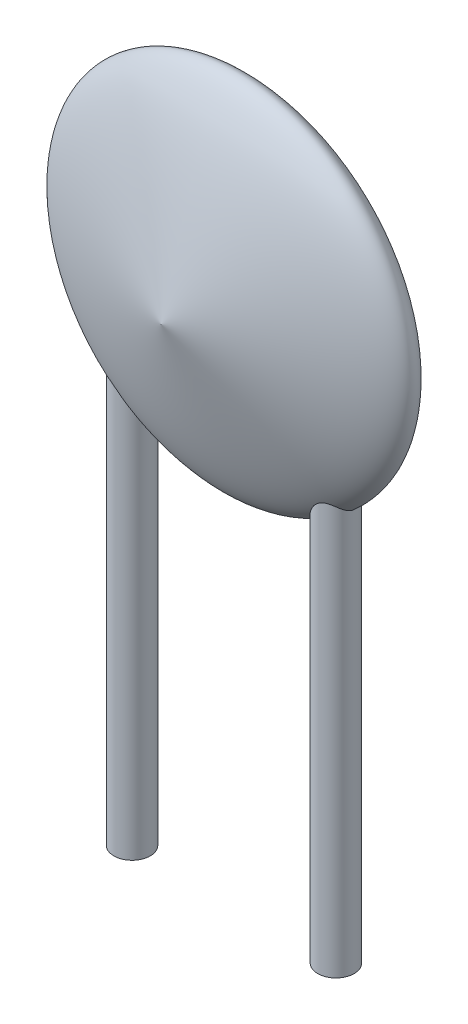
ISO-10303-21;
HEADER;
FILE_DESCRIPTION(('STEP AP214'),'2;1');
FILE_NAME('part.step','',(''),(''),'','','');
FILE_SCHEMA(('AUTOMOTIVE_DESIGN { 1 0 10303 214 1 1 1 1 }'));
ENDSEC;
DATA;
#1=APPLICATION_CONTEXT('core data for automotive mechanical design processes');
#2=APPLICATION_PROTOCOL_DEFINITION('international standard','automotive_design',2000,#1);
#3=PRODUCT_CONTEXT('',#1,'mechanical');
#4=PRODUCT('Part','Part','',(#3));
#5=PRODUCT_RELATED_PRODUCT_CATEGORY('part','',(#4));
#6=PRODUCT_DEFINITION_FORMATION('','',#4);
#7=PRODUCT_DEFINITION_CONTEXT('part definition',#1,'design');
#8=PRODUCT_DEFINITION('design','',#6,#7);
#9=PRODUCT_DEFINITION_SHAPE('','',#8);
#10=(LENGTH_UNIT() NAMED_UNIT(*) SI_UNIT(.MILLI.,.METRE.));
#11=(NAMED_UNIT(*) PLANE_ANGLE_UNIT() SI_UNIT($,.RADIAN.));
#12=(NAMED_UNIT(*) SI_UNIT($,.STERADIAN.) SOLID_ANGLE_UNIT());
#13=UNCERTAINTY_MEASURE_WITH_UNIT(LENGTH_MEASURE(1.E-05),#10,'distance_accuracy_value','');
#14=(GEOMETRIC_REPRESENTATION_CONTEXT(3) GLOBAL_UNCERTAINTY_ASSIGNED_CONTEXT((#13)) GLOBAL_UNIT_ASSIGNED_CONTEXT((#10,
#11,#12)) REPRESENTATION_CONTEXT('',''));
#15=CARTESIAN_POINT('',(0.,0.,0.));
#16=DIRECTION('',(0.,0.,1.));
#17=DIRECTION('',(1.,0.,0.));
#18=AXIS2_PLACEMENT_3D('',#15,#16,#17);
#19=CARTESIAN_POINT('',(-1.4,-7.4,0.));
#20=DIRECTION('',(0.,1.,0.));
#21=DIRECTION('',(0.,0.,1.));
#22=AXIS2_PLACEMENT_3D('',#19,#20,#21);
#23=CYLINDRICAL_SURFACE('',#22,0.25);
#24=CARTESIAN_POINT('',(-1.4,-7.4,0.));
#25=DIRECTION('',(0.,1.,0.));
#26=DIRECTION('',(0.,0.,1.));
#27=AXIS2_PLACEMENT_3D('',#24,#25,#26);
#28=CIRCLE('',#27,0.25);
#29=CARTESIAN_POINT('',(-1.4,-7.4,0.25));
#30=VERTEX_POINT('',#29);
#31=EDGE_CURVE('E40',#30,#30,#28,.T.);
#32=ORIENTED_EDGE('',*,*,#31,.T.);
#33=EDGE_LOOP('',(#32));
#34=FACE_BOUND('',#33,.T.);
#35=CARTESIAN_POINT('',(-1.4,-1.80608390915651,0.25));
#36=CARTESIAN_POINT('',(-1.38321930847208,-1.81908925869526,0.250001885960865));
#37=CARTESIAN_POINT('',(-1.36790400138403,-1.83402348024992,0.248350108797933));
#38=CARTESIAN_POINT('',(-1.33945258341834,-1.86557712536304,0.242992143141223));
#39=CARTESIAN_POINT('',(-1.32634121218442,-1.88221268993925,0.239264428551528));
#40=CARTESIAN_POINT('',(-1.3028636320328,-1.91471312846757,0.230661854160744));
#41=CARTESIAN_POINT('',(-1.2923564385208,-1.93051190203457,0.225921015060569));
#42=CARTESIAN_POINT('',(-1.2724047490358,-1.96240689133,0.215284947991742));
#43=CARTESIAN_POINT('',(-1.26296164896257,-1.97850346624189,0.209388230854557));
#44=CARTESIAN_POINT('',(-1.24497755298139,-2.01071773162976,0.19644485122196));
#45=CARTESIAN_POINT('',(-1.23643572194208,-2.02683538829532,0.189399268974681));
#46=CARTESIAN_POINT('',(-1.2201670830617,-2.05884202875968,0.174026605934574));
#47=CARTESIAN_POINT('',(-1.21243933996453,-2.0747312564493,0.165701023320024));
#48=CARTESIAN_POINT('',(-1.19759699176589,-2.10637196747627,0.147234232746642));
#49=CARTESIAN_POINT('',(-1.19050196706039,-2.12211061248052,0.137053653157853));
#50=CARTESIAN_POINT('',(-1.18063347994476,-2.144710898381,0.120084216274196));
#51=CARTESIAN_POINT('',(-1.17748084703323,-2.15205696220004,0.114163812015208));
#52=CARTESIAN_POINT('',(-1.17147996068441,-2.16625267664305,0.101622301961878));
#53=CARTESIAN_POINT('',(-1.16863123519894,-2.17310309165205,0.0950023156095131));
#54=CARTESIAN_POINT('',(-1.16415002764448,-2.18402783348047,0.0830768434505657));
#55=CARTESIAN_POINT('',(-1.16241391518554,-2.1883053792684,0.0779982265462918));
#56=CARTESIAN_POINT('',(-1.1591806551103,-2.19634233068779,0.0673573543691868));
#57=CARTESIAN_POINT('',(-1.15768379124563,-2.20010112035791,0.0617945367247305));
#58=CARTESIAN_POINT('',(-1.15499037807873,-2.20691759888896,0.0500694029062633));
#59=CARTESIAN_POINT('',(-1.15379817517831,-2.20996509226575,0.043899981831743));
#60=CARTESIAN_POINT('',(-1.15185548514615,-2.21496201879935,0.0310780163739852));
#61=CARTESIAN_POINT('',(-1.15110296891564,-2.21691649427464,0.0244278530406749));
#62=CARTESIAN_POINT('',(-1.15026537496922,-2.21910039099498,0.0125795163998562));
#63=CARTESIAN_POINT('',(-1.15005831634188,-2.2196444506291,0.00744848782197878));
#64=CARTESIAN_POINT('',(-1.14996296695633,-2.21989419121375,-0.00283516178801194));
#65=CARTESIAN_POINT('',(-1.15007458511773,-2.21960011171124,-0.00798777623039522));
#66=CARTESIAN_POINT('',(-1.15087474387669,-2.21750954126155,-0.0232015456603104));
#67=CARTESIAN_POINT('',(-1.15202438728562,-2.21451557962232,-0.0330817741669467));
#68=CARTESIAN_POINT('',(-1.15490551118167,-2.20713374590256,-0.049889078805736));
#69=CARTESIAN_POINT('',(-1.15648822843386,-2.20311062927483,-0.0570230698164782));
#70=CARTESIAN_POINT('',(-1.1600668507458,-2.19412580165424,-0.0705739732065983));
#71=CARTESIAN_POINT('',(-1.16206387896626,-2.18916154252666,-0.0769888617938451));
#72=CARTESIAN_POINT('',(-1.16836372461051,-2.17370396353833,-0.094883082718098));
#73=CARTESIAN_POINT('',(-1.17307583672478,-2.1623828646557,-0.105485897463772));
#74=CARTESIAN_POINT('',(-1.18322529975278,-2.13867290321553,-0.125016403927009));
#75=CARTESIAN_POINT('',(-1.18866539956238,-2.12628005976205,-0.133937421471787));
#76=CARTESIAN_POINT('',(-1.20093259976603,-2.09916557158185,-0.151671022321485));
#77=CARTESIAN_POINT('',(-1.20784728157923,-2.08436056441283,-0.160294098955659));
#78=CARTESIAN_POINT('',(-1.22238766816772,-2.05440744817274,-0.176267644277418));
#79=CARTESIAN_POINT('',(-1.23001412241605,-2.03925899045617,-0.183616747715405));
#80=CARTESIAN_POINT('',(-1.24599329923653,-2.00889489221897,-0.197209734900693));
#81=CARTESIAN_POINT('',(-1.2543445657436,-1.99367944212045,-0.203455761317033));
#82=CARTESIAN_POINT('',(-1.27188483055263,-1.96335007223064,-0.214933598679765));
#83=CARTESIAN_POINT('',(-1.28107367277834,-1.94823613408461,-0.220165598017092));
#84=CARTESIAN_POINT('',(-1.29895831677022,-1.92065975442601,-0.228852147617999));
#85=CARTESIAN_POINT('',(-1.30750840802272,-1.9081506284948,-0.232456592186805));
#86=CARTESIAN_POINT('',(-1.3255108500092,-1.88353894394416,-0.238836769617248));
#87=CARTESIAN_POINT('',(-1.3349644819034,-1.87143699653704,-0.241611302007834));
#88=CARTESIAN_POINT('',(-1.35512447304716,-1.84784375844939,-0.246158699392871));
#89=CARTESIAN_POINT('',(-1.36584399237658,-1.83636109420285,-0.24791967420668));
#90=CARTESIAN_POINT('',(-1.38871423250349,-1.81482404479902,-0.250011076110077));
#91=CARTESIAN_POINT('',(-1.40085794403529,-1.80476316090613,-0.25034823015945));
#92=CARTESIAN_POINT('',(-1.42660090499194,-1.78752535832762,-0.248897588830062));
#93=CARTESIAN_POINT('',(-1.44014503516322,-1.78027042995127,-0.247173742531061));
#94=CARTESIAN_POINT('',(-1.461299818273,-1.77269295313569,-0.242478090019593));
#95=CARTESIAN_POINT('',(-1.46854118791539,-1.77071612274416,-0.240541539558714));
#96=CARTESIAN_POINT('',(-1.48303044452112,-1.76808103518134,-0.235930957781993));
#97=CARTESIAN_POINT('',(-1.4902783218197,-1.76742173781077,-0.233257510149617));
#98=CARTESIAN_POINT('',(-1.50367220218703,-1.76741700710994,-0.22759378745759));
#99=CARTESIAN_POINT('',(-1.50984942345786,-1.76792993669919,-0.224674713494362));
#100=CARTESIAN_POINT('',(-1.52183897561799,-1.76985354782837,-0.218405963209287));
#101=CARTESIAN_POINT('',(-1.52765068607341,-1.77126571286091,-0.215055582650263));
#102=CARTESIAN_POINT('',(-1.54187828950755,-1.77576961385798,-0.206094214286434));
#103=CARTESIAN_POINT('',(-1.54998562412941,-1.77935732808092,-0.200246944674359));
#104=CARTESIAN_POINT('',(-1.56514677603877,-1.78759135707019,-0.187943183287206));
#105=CARTESIAN_POINT('',(-1.57219576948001,-1.7922422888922,-0.181484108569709));
#106=CARTESIAN_POINT('',(-1.58992336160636,-1.80553626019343,-0.163354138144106));
#107=CARTESIAN_POINT('',(-1.59970463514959,-1.81470125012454,-0.151190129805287));
#108=CARTESIAN_POINT('',(-1.61690179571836,-1.83289313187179,-0.125286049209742));
#109=CARTESIAN_POINT('',(-1.62432104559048,-1.84192020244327,-0.111548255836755));
#110=CARTESIAN_POINT('',(-1.6370993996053,-1.85869194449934,-0.0810433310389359));
#111=CARTESIAN_POINT('',(-1.64232098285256,-1.86633737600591,-0.0641502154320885));
#112=CARTESIAN_POINT('',(-1.64710890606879,-1.87360354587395,-0.0386705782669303));
#113=CARTESIAN_POINT('',(-1.64819766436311,-1.87530443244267,-0.0309786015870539));
#114=CARTESIAN_POINT('',(-1.64964995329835,-1.87759548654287,-0.0153652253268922));
#115=CARTESIAN_POINT('',(-1.65001455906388,-1.87818730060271,-0.00744418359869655));
#116=CARTESIAN_POINT('',(-1.64998451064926,-1.87813918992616,0.00840884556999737));
#117=CARTESIAN_POINT('',(-1.6495882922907,-1.87749672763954,0.0163408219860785));
#118=CARTESIAN_POINT('',(-1.64807265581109,-1.87510886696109,0.031966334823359));
#119=CARTESIAN_POINT('',(-1.64695219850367,-1.87336188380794,0.0396595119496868));
#120=CARTESIAN_POINT('',(-1.64347892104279,-1.8681006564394,0.0577428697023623));
#121=CARTESIAN_POINT('',(-1.64080902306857,-1.86415533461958,0.0679437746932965));
#122=CARTESIAN_POINT('',(-1.63440814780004,-1.85518340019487,0.087518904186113));
#123=CARTESIAN_POINT('',(-1.63067271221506,-1.85015226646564,0.0968894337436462));
#124=CARTESIAN_POINT('',(-1.61965672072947,-1.83623680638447,0.120464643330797));
#125=CARTESIAN_POINT('',(-1.61161754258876,-1.82690501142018,0.134043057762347));
#126=CARTESIAN_POINT('',(-1.59308958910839,-1.80849244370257,0.159575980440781));
#127=CARTESIAN_POINT('',(-1.5826068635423,-1.79941111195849,0.171534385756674));
#128=CARTESIAN_POINT('',(-1.56500497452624,-1.78762905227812,0.187968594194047));
#129=CARTESIAN_POINT('',(-1.55903240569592,-1.78409115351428,0.193061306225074));
#130=CARTESIAN_POINT('',(-1.54636721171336,-1.77779420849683,0.202831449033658));
#131=CARTESIAN_POINT('',(-1.53967509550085,-1.77503461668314,0.207509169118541));
#132=CARTESIAN_POINT('',(-1.5266486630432,-1.77098344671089,0.215661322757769));
#133=CARTESIAN_POINT('',(-1.52041238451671,-1.76953331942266,0.219210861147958));
#134=CARTESIAN_POINT('',(-1.5075390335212,-1.76768114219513,0.225803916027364));
#135=CARTESIAN_POINT('',(-1.50090297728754,-1.76727654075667,0.228848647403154));
#136=CARTESIAN_POINT('',(-1.48737565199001,-1.7676530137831,0.234348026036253));
#137=CARTESIAN_POINT('',(-1.4804831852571,-1.76844058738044,0.236799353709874));
#138=CARTESIAN_POINT('',(-1.4667280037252,-1.77118981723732,0.241038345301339));
#139=CARTESIAN_POINT('',(-1.45986534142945,-1.77315305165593,0.242825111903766));
#140=CARTESIAN_POINT('',(-1.43713434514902,-1.78149047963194,0.24776617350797));
#141=CARTESIAN_POINT('',(-1.42178894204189,-1.79022484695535,0.249447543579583));
#142=CARTESIAN_POINT('',(-1.40508202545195,-1.80221459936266,0.249962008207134));
#143=CARTESIAN_POINT('',(-1.40252443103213,-1.80412742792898,0.249999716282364));
#144=CARTESIAN_POINT('',(-1.4,-1.80608390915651,0.25));
#145=B_SPLINE_CURVE_WITH_KNOTS('',3,(#35,#36,#37,#38,#39,#40,#41,#42,#43,#44,#45,#46,#47,#48,
#49,#50,#51,#52,#53,#54,#55,#56,#57,#58,#59,#60,#61,#62,#63,#64,#65,#66,#67,#68,#69,#70,#71,#72,
#73,#74,#75,#76,#77,#78,#79,#80,#81,#82,#83,#84,#85,#86,#87,#88,#89,#90,#91,#92,#93,#94,#95,#96,
#97,#98,#99,#100,#101,#102,#103,#104,#105,#106,#107,#108,#109,#110,#111,#112,#113,#114,#115,
#116,#117,#118,#119,#120,#121,#122,#123,#124,#125,#126,#127,#128,#129,#130,#131,#132,#133,#134,
#135,#136,#137,#138,#139,#140,#141,#142,#143,#144),.UNSPECIFIED.,.T.,.F.,(4,2,2,2,2,2,2,2,2,2,2,
2,2,2,2,2,2,2,2,2,2,2,2,2,2,2,2,2,2,2,2,2,2,2,2,2,2,2,2,2,2,2,2,2,2,2,2,2,2,2,2,2,2,2,4),(0.,
0.0637281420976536,0.128129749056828,0.186714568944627,0.245375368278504,0.303981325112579,
0.362519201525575,0.42248652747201,0.452301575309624,0.482069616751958,0.502628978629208,
0.523212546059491,0.544075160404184,0.564840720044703,0.580258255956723,0.595671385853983,
0.626315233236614,0.651236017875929,0.676225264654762,0.724592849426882,0.773148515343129,
0.82849216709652,0.883894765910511,0.939188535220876,0.994472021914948,1.04115449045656,
1.08790416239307,1.13519163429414,1.18225544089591,1.22789606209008,1.25101987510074,
1.2741254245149,1.29458850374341,1.31508542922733,1.34676204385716,1.37857891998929,
1.43258599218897,1.48651582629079,1.54344492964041,1.56720684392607,1.59093345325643,
1.61470889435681,1.63851852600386,1.67210211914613,1.70582834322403,1.76057077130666,
1.81517908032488,1.84095321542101,1.86670923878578,1.88858418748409,1.91040570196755,
1.93234660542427,1.95431702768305,2.00634240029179,2.01592944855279),.UNSPECIFIED.);
#146=CARTESIAN_POINT('',(-1.4,-1.80608390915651,0.25));
#147=VERTEX_POINT('',#146);
#148=EDGE_CURVE('E11',#147,#147,#145,.T.);
#149=ORIENTED_EDGE('',*,*,#148,.F.);
#150=EDGE_LOOP('',(#149));
#151=FACE_BOUND('',#150,.T.);
#152=ADVANCED_FACE('F26',(#34,#151),#23,.T.);
#153=CARTESIAN_POINT('',(-1.4,-7.4,0.));
#154=DIRECTION('',(0.,1.,0.));
#155=DIRECTION('',(0.,0.,1.));
#156=AXIS2_PLACEMENT_3D('',#153,#154,#155);
#157=PLANE('',#156);
#158=ORIENTED_EDGE('',*,*,#31,.F.);
#159=EDGE_LOOP('',(#158));
#160=FACE_BOUND('',#159,.T.);
#161=ADVANCED_FACE('F48',(#160),#157,.F.);
#162=CARTESIAN_POINT('',(0.,0.,-1.));
#163=CARTESIAN_POINT('',(0.,1.25,-0.666666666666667));
#164=CARTESIAN_POINT('',(0.,3.75,0.));
#165=CARTESIAN_POINT('',(0.,1.25,0.666666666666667));
#166=CARTESIAN_POINT('',(0.,0.,1.));
#167=B_SPLINE_CURVE_WITH_KNOTS('',3,(#162,#163,#164,#165,#166),.UNSPECIFIED.,.F.,.F.,(4,1,4),
(0.,0.5,1.),.UNSPECIFIED.);
#168=CARTESIAN_POINT('',(0.,0.,4.80283073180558));
#169=DIRECTION('',(0.,0.,1.));
#170=AXIS1_PLACEMENT('',#168,#169);
#171=SURFACE_OF_REVOLUTION('',#167,#170);
#172=CARTESIAN_POINT('',(1.4,-1.80608390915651,0.25));
#173=CARTESIAN_POINT('',(1.40633326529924,-1.80117501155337,0.249999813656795));
#174=CARTESIAN_POINT('',(1.41288346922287,-1.79654182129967,0.249760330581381));
#175=CARTESIAN_POINT('',(1.42643101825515,-1.78804182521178,0.248691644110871));
#176=CARTESIAN_POINT('',(1.43342836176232,-1.78417501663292,0.247862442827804));
#177=CARTESIAN_POINT('',(1.44790051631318,-1.77744033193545,0.245478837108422));
#178=CARTESIAN_POINT('',(1.4553803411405,-1.77458605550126,0.243915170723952));
#179=CARTESIAN_POINT('',(1.47051538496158,-1.77024141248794,0.239975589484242));
#180=CARTESIAN_POINT('',(1.47817018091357,-1.76874805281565,0.237601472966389));
#181=CARTESIAN_POINT('',(1.49246094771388,-1.76733289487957,0.232383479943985));
#182=CARTESIAN_POINT('',(1.49911277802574,-1.76724999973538,0.229625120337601));
#183=CARTESIAN_POINT('',(1.51209335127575,-1.76816749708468,0.223576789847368));
#184=CARTESIAN_POINT('',(1.51842172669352,-1.76916909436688,0.220286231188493));
#185=CARTESIAN_POINT('',(1.54066027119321,-1.77445535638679,0.207510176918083));
#186=CARTESIAN_POINT('',(1.55517443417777,-1.78143027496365,0.196752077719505));
#187=CARTESIAN_POINT('',(1.57898627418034,-1.79672192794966,0.175189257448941));
#188=CARTESIAN_POINT('',(1.58872320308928,-1.80473152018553,0.164585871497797));
#189=CARTESIAN_POINT('',(1.60619378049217,-1.82119720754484,0.142074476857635));
#190=CARTESIAN_POINT('',(1.61392418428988,-1.82965399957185,0.130164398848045));
#191=CARTESIAN_POINT('',(1.62539854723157,-1.84336759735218,0.108611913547));
#192=CARTESIAN_POINT('',(1.62964287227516,-1.84882377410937,0.0993598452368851));
#193=CARTESIAN_POINT('',(1.63708195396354,-1.85884574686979,0.0799943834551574));
#194=CARTESIAN_POINT('',(1.64027969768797,-1.86341406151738,0.0698835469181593));
#195=CARTESIAN_POINT('',(1.64470425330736,-1.86993608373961,0.0517720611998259));
#196=CARTESIAN_POINT('',(1.64623268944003,-1.87226384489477,0.0439829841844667));
#197=CARTESIAN_POINT('',(1.64854970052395,-1.87584904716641,0.0280613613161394));
#198=CARTESIAN_POINT('',(1.64933995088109,-1.8771089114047,0.0199296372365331));
#199=CARTESIAN_POINT('',(1.65011231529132,-1.87833930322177,0.00346768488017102));
#200=CARTESIAN_POINT('',(1.65008880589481,-1.8783008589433,-0.00486352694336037));
#201=CARTESIAN_POINT('',(1.64922225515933,-1.87692163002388,-0.0213750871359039));
#202=CARTESIAN_POINT('',(1.6483782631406,-1.87557933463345,-0.02955524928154));
#203=CARTESIAN_POINT('',(1.64566227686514,-1.87138801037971,-0.0474360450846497));
#204=CARTESIAN_POINT('',(1.64359428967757,-1.86825761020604,-0.0570384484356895));
#205=CARTESIAN_POINT('',(1.63850613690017,-1.86088837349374,-0.0755480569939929));
#206=CARTESIAN_POINT('',(1.63548280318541,-1.85664585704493,-0.0844528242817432));
#207=CARTESIAN_POINT('',(1.62633064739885,-1.84446687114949,-0.10729477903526));
#208=CARTESIAN_POINT('',(1.61947573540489,-1.83595445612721,-0.120625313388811));
#209=CARTESIAN_POINT('',(1.60365724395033,-1.81865571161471,-0.145755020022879));
#210=CARTESIAN_POINT('',(1.59469286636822,-1.80986927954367,-0.157553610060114));
#211=CARTESIAN_POINT('',(1.57853293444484,-1.79681588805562,-0.175225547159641));
#212=CARTESIAN_POINT('',(1.5721255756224,-1.79217607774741,-0.181540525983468));
#213=CARTESIAN_POINT('',(1.55837160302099,-1.78368740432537,-0.193654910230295));
#214=CARTESIAN_POINT('',(1.55102720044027,-1.77983673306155,-0.199455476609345));
#215=CARTESIAN_POINT('',(1.537214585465,-1.7742015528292,-0.209105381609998));
#216=CARTESIAN_POINT('',(1.53095578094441,-1.77214324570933,-0.213089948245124));
#217=CARTESIAN_POINT('',(1.51791949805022,-1.76905504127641,-0.220570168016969));
#218=CARTESIAN_POINT('',(1.51114324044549,-1.76802279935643,-0.224066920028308));
#219=CARTESIAN_POINT('',(1.4971576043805,-1.76720741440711,-0.23047764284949));
#220=CARTESIAN_POINT('',(1.48994464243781,-1.76743656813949,-0.233385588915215));
#221=CARTESIAN_POINT('',(1.47543346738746,-1.76924267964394,-0.23847252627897));
#222=CARTESIAN_POINT('',(1.46813523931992,-1.77081987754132,-0.240651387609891));
#223=CARTESIAN_POINT('',(1.44839093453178,-1.77682130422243,-0.245611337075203));
#224=CARTESIAN_POINT('',(1.43613481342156,-1.78248892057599,-0.247643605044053));
#225=CARTESIAN_POINT('',(1.41431006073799,-1.79534526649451,-0.249806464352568));
#226=CARTESIAN_POINT('',(1.40459466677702,-1.8022800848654,-0.250130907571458));
#227=CARTESIAN_POINT('',(1.38607624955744,-1.81728031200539,-0.249782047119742));
#228=CARTESIAN_POINT('',(1.37727616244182,-1.82534917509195,-0.249105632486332));
#229=CARTESIAN_POINT('',(1.35221457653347,-1.85043202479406,-0.24597118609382));
#230=CARTESIAN_POINT('',(1.3371164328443,-1.86844608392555,-0.242415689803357));
#231=CARTESIAN_POINT('',(1.30900740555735,-1.90562426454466,-0.233317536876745));
#232=CARTESIAN_POINT('',(1.29600887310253,-1.9247943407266,-0.227763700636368));
#233=CARTESIAN_POINT('',(1.27303163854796,-1.96131039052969,-0.215700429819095));
#234=CARTESIAN_POINT('',(1.2628775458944,-1.97860859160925,-0.209377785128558));
#235=CARTESIAN_POINT('',(1.24358748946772,-2.0132566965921,-0.195390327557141));
#236=CARTESIAN_POINT('',(1.2344526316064,-2.03060663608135,-0.187724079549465));
#237=CARTESIAN_POINT('',(1.2171676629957,-2.0649162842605,-0.170928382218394));
#238=CARTESIAN_POINT('',(1.20901132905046,-2.08187783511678,-0.161809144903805));
#239=CARTESIAN_POINT('',(1.19362577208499,-2.11510204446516,-0.141675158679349));
#240=CARTESIAN_POINT('',(1.18639547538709,-2.131365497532,-0.130662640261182));
#241=CARTESIAN_POINT('',(1.17618217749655,-2.15509001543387,-0.11163057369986));
#242=CARTESIAN_POINT('',(1.17278296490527,-2.16313934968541,-0.104587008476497));
#243=CARTESIAN_POINT('',(1.16643132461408,-2.17842351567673,-0.0895174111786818));
#244=CARTESIAN_POINT('',(1.16347808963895,-2.18565981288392,-0.0814932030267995));
#245=CARTESIAN_POINT('',(1.15756672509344,-2.20035452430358,-0.0620545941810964));
#246=CARTESIAN_POINT('',(1.15477017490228,-2.20746634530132,-0.050286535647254));
#247=CARTESIAN_POINT('',(1.15207398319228,-2.21439945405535,-0.0325312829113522));
#248=CARTESIAN_POINT('',(1.15144626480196,-2.21602585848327,-0.0273703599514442));
#249=CARTESIAN_POINT('',(1.1505117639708,-2.21845621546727,-0.0168359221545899));
#250=CARTESIAN_POINT('',(1.15020421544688,-2.21926213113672,-0.0114629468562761));
#251=CARTESIAN_POINT('',(1.14994178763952,-2.21994914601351,-0.000619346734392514));
#252=CARTESIAN_POINT('',(1.14998872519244,-2.21982548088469,0.00485163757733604));
#253=CARTESIAN_POINT('',(1.15043307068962,-2.21866321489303,0.0156817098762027));
#254=CARTESIAN_POINT('',(1.15083085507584,-2.21762363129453,0.021040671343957));
#255=CARTESIAN_POINT('',(1.15273639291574,-2.21268299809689,0.039053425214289));
#256=CARTESIAN_POINT('',(1.15501756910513,-2.20681743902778,0.0510800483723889));
#257=CARTESIAN_POINT('',(1.16022125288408,-2.1937276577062,0.0714291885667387));
#258=CARTESIAN_POINT('',(1.16299918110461,-2.1868322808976,0.0800364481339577));
#259=CARTESIAN_POINT('',(1.16907307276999,-2.17202716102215,0.0961555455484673));
#260=CARTESIAN_POINT('',(1.17237033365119,-2.16411488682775,0.10366454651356));
#261=CARTESIAN_POINT('',(1.17968673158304,-2.14688987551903,0.118479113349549));
#262=CARTESIAN_POINT('',(1.18374498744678,-2.13751597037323,0.125691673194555));
#263=CARTESIAN_POINT('',(1.19223711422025,-2.11833427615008,0.139277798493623));
#264=CARTESIAN_POINT('',(1.19667135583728,-2.10852606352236,0.145650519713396));
#265=CARTESIAN_POINT('',(1.21052004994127,-2.07861826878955,0.163803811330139));
#266=CARTESIAN_POINT('',(1.22044322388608,-2.05812478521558,0.174549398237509));
#267=CARTESIAN_POINT('',(1.23946467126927,-2.02106153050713,0.19198388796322));
#268=CARTESIAN_POINT('',(1.24832165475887,-2.00453951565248,0.199053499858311));
#269=CARTESIAN_POINT('',(1.267010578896,-1.9715328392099,0.211999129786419));
#270=CARTESIAN_POINT('',(1.27684399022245,-1.95504827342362,0.217873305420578));
#271=CARTESIAN_POINT('',(1.29759574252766,-1.92255587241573,0.228358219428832));
#272=CARTESIAN_POINT('',(1.30850492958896,-1.90654530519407,0.232978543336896));
#273=CARTESIAN_POINT('',(1.33178999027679,-1.87528941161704,0.24082973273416));
#274=CARTESIAN_POINT('',(1.34416144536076,-1.86004196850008,0.244064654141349));
#275=CARTESIAN_POINT('',(1.36407817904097,-1.83849538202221,0.247493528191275));
#276=CARTESIAN_POINT('',(1.37085878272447,-1.83160542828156,0.248396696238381));
#277=CARTESIAN_POINT('',(1.38498718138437,-1.81837050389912,0.249649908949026));
#278=CARTESIAN_POINT('',(1.39233469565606,-1.81202526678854,0.250000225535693));
#279=CARTESIAN_POINT('',(1.4,-1.80608390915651,0.25));
#280=B_SPLINE_CURVE_WITH_KNOTS('',3,(#172,#173,#174,#175,#176,#177,#178,#179,#180,#181,#182,
#183,#184,#185,#186,#187,#188,#189,#190,#191,#192,#193,#194,#195,#196,#197,#198,#199,#200,#201,
#202,#203,#204,#205,#206,#207,#208,#209,#210,#211,#212,#213,#214,#215,#216,#217,#218,#219,#220,
#221,#222,#223,#224,#225,#226,#227,#228,#229,#230,#231,#232,#233,#234,#235,#236,#237,#238,#239,
#240,#241,#242,#243,#244,#245,#246,#247,#248,#249,#250,#251,#252,#253,#254,#255,#256,#257,#258,
#259,#260,#261,#262,#263,#264,#265,#266,#267,#268,#269,#270,#271,#272,#273,#274,#275,#276,#277,
#278,#279),.UNSPECIFIED.,.T.,.F.,(4,2,2,2,2,2,2,2,2,2,2,2,2,2,2,2,2,2,2,2,2,2,2,2,2,2,2,2,2,2,2,
2,2,2,2,2,2,2,2,2,2,2,2,2,2,2,2,2,2,2,2,2,2,4),(0.,0.0240255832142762,0.048051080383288,
0.0723880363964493,0.0966713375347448,0.118159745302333,0.139672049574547,0.196635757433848,
0.245929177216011,0.295301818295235,0.329875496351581,0.364349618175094,0.389077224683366,
0.413748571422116,0.438590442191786,0.463461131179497,0.494216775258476,0.525075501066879,
0.576524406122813,0.627992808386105,0.658299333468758,0.688535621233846,0.711553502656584,
0.734518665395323,0.757708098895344,0.780901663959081,0.821270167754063,0.856938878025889,
0.892718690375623,0.963650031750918,1.03498452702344,1.09800587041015,1.1610949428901,
1.22375872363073,1.28634917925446,1.31995169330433,1.35349263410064,1.39490689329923,
1.41118597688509,1.42742601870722,1.44374935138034,1.46009021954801,1.50000079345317,
1.53401383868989,1.56811324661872,1.60557374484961,1.64307161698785,1.7184227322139,
1.77848178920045,1.83863271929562,1.89830994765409,1.95781124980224,1.98690430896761,
2.01598305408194),.UNSPECIFIED.);
#281=CARTESIAN_POINT('',(1.4,-1.80608390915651,0.25));
#282=VERTEX_POINT('',#281);
#283=EDGE_CURVE('E32',#282,#282,#280,.T.);
#284=ORIENTED_EDGE('',*,*,#283,.T.);
#285=EDGE_LOOP('',(#284));
#286=FACE_BOUND('',#285,.T.);
#287=ORIENTED_EDGE('',*,*,#148,.T.);
#288=EDGE_LOOP('',(#287));
#289=FACE_BOUND('',#288,.T.);
#290=CARTESIAN_POINT('',(0.,0.,1.));
#291=VERTEX_POINT('',#290);
#292=VERTEX_LOOP('',#291);
#293=FACE_BOUND('',#292,.T.);
#294=CARTESIAN_POINT('',(0.,0.,-1.));
#295=VERTEX_POINT('',#294);
#296=VERTEX_LOOP('',#295);
#297=FACE_BOUND('',#296,.T.);
#298=ADVANCED_FACE('F28',(#286,#289,#293,#297),#171,.T.);
#299=CARTESIAN_POINT('',(1.4,-7.4,0.));
#300=DIRECTION('',(0.,1.,0.));
#301=DIRECTION('',(0.,0.,1.));
#302=AXIS2_PLACEMENT_3D('',#299,#300,#301);
#303=CYLINDRICAL_SURFACE('',#302,0.25);
#304=CARTESIAN_POINT('',(1.4,-7.4,0.));
#305=DIRECTION('',(0.,1.,0.));
#306=DIRECTION('',(0.,0.,1.));
#307=AXIS2_PLACEMENT_3D('',#304,#305,#306);
#308=CIRCLE('',#307,0.25);
#309=CARTESIAN_POINT('',(1.4,-7.4,0.25));
#310=VERTEX_POINT('',#309);
#311=EDGE_CURVE('E77',#310,#310,#308,.T.);
#312=ORIENTED_EDGE('',*,*,#311,.T.);
#313=EDGE_LOOP('',(#312));
#314=FACE_BOUND('',#313,.T.);
#315=ORIENTED_EDGE('',*,*,#283,.F.);
#316=EDGE_LOOP('',(#315));
#317=FACE_BOUND('',#316,.T.);
#318=ADVANCED_FACE('F47',(#314,#317),#303,.T.);
#319=CARTESIAN_POINT('',(1.4,-7.4,0.));
#320=DIRECTION('',(0.,1.,0.));
#321=DIRECTION('',(0.,0.,1.));
#322=AXIS2_PLACEMENT_3D('',#319,#320,#321);
#323=PLANE('',#322);
#324=ORIENTED_EDGE('',*,*,#311,.F.);
#325=EDGE_LOOP('',(#324));
#326=FACE_BOUND('',#325,.T.);
#327=ADVANCED_FACE('F54',(#326),#323,.F.);
#328=CLOSED_SHELL('',(#152,#161,#298,#318,#327));
#329=MANIFOLD_SOLID_BREP('B2',#328);
#330=ADVANCED_BREP_SHAPE_REPRESENTATION('',(#18,#329),#14);
#331=SHAPE_DEFINITION_REPRESENTATION(#9,#330);
ENDSEC;
END-ISO-10303-21;
